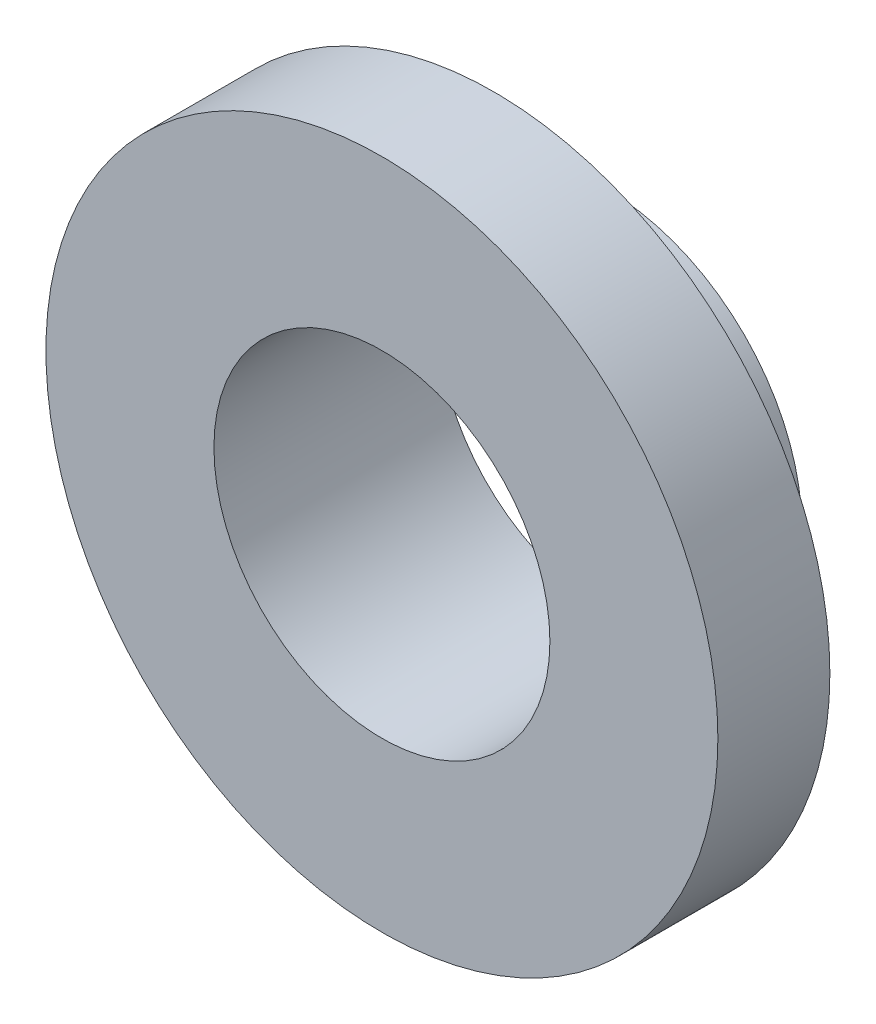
from build123d import *

# Parameters (mm, degrees)
SKETCH_1_R          = 3
EXTRUDE_1_DEPTH     = 1
SKETCH_2_R          = 1.75
EXTRUDE_2_DEPTH     = 1
SKETCH_3_R          = 1.5
CUT_EXTRUDE_1_DEPTH = 2


with BuildPart() as part:
    # Sketch 1 → Extrude 1 (new body)
    with BuildSketch(Plane.XY):
        Circle(SKETCH_1_R)
    extrude(amount=EXTRUDE_1_DEPTH)

    # Sketch 2 → Extrude 2 (add)
    with BuildSketch(Plane(origin=(0, 0, 0), x_dir=(-1, 0, 0), z_dir=(0, 0, -1))):
        with Locations(Location((0, 0, 0), (0, 0, 180))):
            Circle(SKETCH_2_R)
    extrude(amount=EXTRUDE_2_DEPTH)

    # Sketch 3 → Cut-Extrude 1 (cut)
    with BuildSketch(Plane(origin=(0, 0, -1), x_dir=(-1, 0, 0), z_dir=(0, 0, -1))):
        Circle(SKETCH_3_R)
    extrude(amount=-CUT_EXTRUDE_1_DEPTH, mode=Mode.SUBTRACT)


solid = part.part
